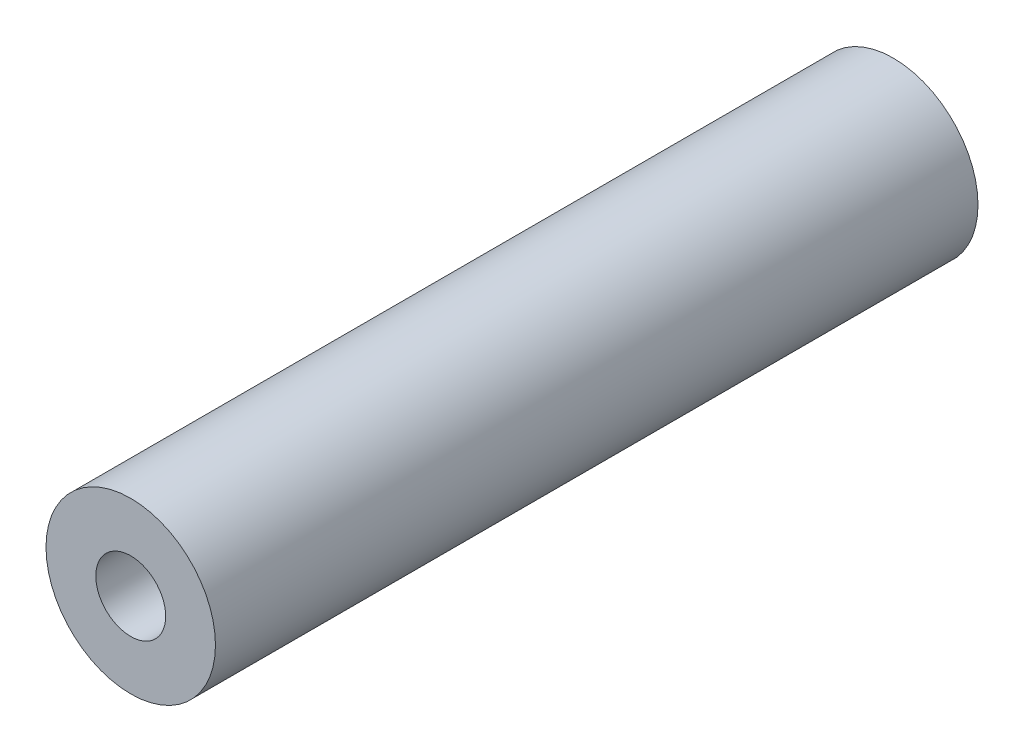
ISO-10303-21;
HEADER;
FILE_DESCRIPTION(('STEP AP214'),'2;1');
FILE_NAME('part.step','',(''),(''),'','','');
FILE_SCHEMA(('AUTOMOTIVE_DESIGN { 1 0 10303 214 1 1 1 1 }'));
ENDSEC;
DATA;
#1=APPLICATION_CONTEXT('core data for automotive mechanical design processes');
#2=APPLICATION_PROTOCOL_DEFINITION('international standard','automotive_design',2000,#1);
#3=PRODUCT_CONTEXT('',#1,'mechanical');
#4=PRODUCT('Part','Part','',(#3));
#5=PRODUCT_RELATED_PRODUCT_CATEGORY('part','',(#4));
#6=PRODUCT_DEFINITION_FORMATION('','',#4);
#7=PRODUCT_DEFINITION_CONTEXT('part definition',#1,'design');
#8=PRODUCT_DEFINITION('design','',#6,#7);
#9=PRODUCT_DEFINITION_SHAPE('','',#8);
#10=(LENGTH_UNIT() NAMED_UNIT(*) SI_UNIT(.MILLI.,.METRE.));
#11=(NAMED_UNIT(*) PLANE_ANGLE_UNIT() SI_UNIT($,.RADIAN.));
#12=(NAMED_UNIT(*) SI_UNIT($,.STERADIAN.) SOLID_ANGLE_UNIT());
#13=UNCERTAINTY_MEASURE_WITH_UNIT(LENGTH_MEASURE(1.E-05),#10,'distance_accuracy_value','');
#14=(GEOMETRIC_REPRESENTATION_CONTEXT(3) GLOBAL_UNCERTAINTY_ASSIGNED_CONTEXT((#13)) GLOBAL_UNIT_ASSIGNED_CONTEXT((#10,
#11,#12)) REPRESENTATION_CONTEXT('',''));
#15=CARTESIAN_POINT('',(0.,0.,0.));
#16=DIRECTION('',(0.,0.,1.));
#17=DIRECTION('',(1.,0.,0.));
#18=AXIS2_PLACEMENT_3D('',#15,#16,#17);
#19=CARTESIAN_POINT('',(-58.,-45.,36.));
#20=DIRECTION('',(0.,0.,-1.));
#21=DIRECTION('',(-1.,0.,0.));
#22=AXIS2_PLACEMENT_3D('',#19,#20,#21);
#23=CYLINDRICAL_SURFACE('',#22,4.);
#24=CARTESIAN_POINT('',(-58.,-45.,36.));
#25=DIRECTION('',(0.,0.,1.));
#26=DIRECTION('',(1.,0.,0.));
#27=AXIS2_PLACEMENT_3D('',#24,#25,#26);
#28=CIRCLE('',#27,4.);
#29=CARTESIAN_POINT('',(-54.,-45.,36.));
#30=VERTEX_POINT('',#29);
#31=EDGE_CURVE('E11',#30,#30,#28,.T.);
#32=ORIENTED_EDGE('',*,*,#31,.F.);
#33=EDGE_LOOP('',(#32));
#34=FACE_BOUND('',#33,.T.);
#35=CARTESIAN_POINT('',(-58.,-45.,0.));
#36=DIRECTION('',(0.,0.,1.));
#37=DIRECTION('',(1.,0.,0.));
#38=AXIS2_PLACEMENT_3D('',#35,#36,#37);
#39=CIRCLE('',#38,4.);
#40=CARTESIAN_POINT('',(-54.,-45.,0.));
#41=VERTEX_POINT('',#40);
#42=EDGE_CURVE('E19',#41,#41,#39,.T.);
#43=ORIENTED_EDGE('',*,*,#42,.T.);
#44=EDGE_LOOP('',(#43));
#45=FACE_BOUND('',#44,.T.);
#46=ADVANCED_FACE('F16',(#34,#45),#23,.T.);
#47=CARTESIAN_POINT('',(-58.,-45.,36.));
#48=DIRECTION('',(0.,0.,1.));
#49=DIRECTION('',(1.,0.,0.));
#50=AXIS2_PLACEMENT_3D('',#47,#48,#49);
#51=PLANE('',#50);
#52=CARTESIAN_POINT('',(-58.,-45.,36.));
#53=DIRECTION('',(0.,0.,1.));
#54=DIRECTION('',(1.,0.,0.));
#55=AXIS2_PLACEMENT_3D('',#52,#53,#54);
#56=CIRCLE('',#55,1.65);
#57=CARTESIAN_POINT('',(-56.35,-45.,36.));
#58=VERTEX_POINT('',#57);
#59=EDGE_CURVE('E40',#58,#58,#56,.T.);
#60=ORIENTED_EDGE('',*,*,#59,.F.);
#61=EDGE_LOOP('',(#60));
#62=FACE_BOUND('',#61,.T.);
#63=ORIENTED_EDGE('',*,*,#31,.T.);
#64=EDGE_LOOP('',(#63));
#65=FACE_BOUND('',#64,.T.);
#66=ADVANCED_FACE('F58',(#62,#65),#51,.T.);
#67=CARTESIAN_POINT('',(-58.,-45.,0.));
#68=DIRECTION('',(0.,0.,1.));
#69=DIRECTION('',(1.,0.,0.));
#70=AXIS2_PLACEMENT_3D('',#67,#68,#69);
#71=PLANE('',#70);
#72=CARTESIAN_POINT('',(-58.,-45.,0.));
#73=DIRECTION('',(0.,0.,-1.));
#74=DIRECTION('',(-1.,0.,0.));
#75=AXIS2_PLACEMENT_3D('',#72,#73,#74);
#76=CIRCLE('',#75,1.65);
#77=CARTESIAN_POINT('',(-59.65,-45.,0.));
#78=VERTEX_POINT('',#77);
#79=EDGE_CURVE('E39',#78,#78,#76,.T.);
#80=ORIENTED_EDGE('',*,*,#79,.F.);
#81=EDGE_LOOP('',(#80));
#82=FACE_BOUND('',#81,.T.);
#83=ORIENTED_EDGE('',*,*,#42,.F.);
#84=EDGE_LOOP('',(#83));
#85=FACE_BOUND('',#84,.T.);
#86=ADVANCED_FACE('F55',(#82,#85),#71,.F.);
#87=CARTESIAN_POINT('',(-58.,-45.,15.5));
#88=DIRECTION('',(0.,0.,-1.));
#89=DIRECTION('',(-1.,0.,0.));
#90=AXIS2_PLACEMENT_3D('',#87,#88,#89);
#91=CONICAL_SURFACE('',#90,1.65,1.02974425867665);
#92=CARTESIAN_POINT('',(-58.,-45.,16.4914200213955));
#93=VERTEX_POINT('',#92);
#94=VERTEX_LOOP('',#93);
#95=FACE_BOUND('',#94,.T.);
#96=CARTESIAN_POINT('',(-58.,-45.,15.5));
#97=DIRECTION('',(0.,0.,-1.));
#98=DIRECTION('',(-1.,0.,0.));
#99=AXIS2_PLACEMENT_3D('',#96,#97,#98);
#100=CIRCLE('',#99,1.65);
#101=CARTESIAN_POINT('',(-59.65,-45.,15.5));
#102=VERTEX_POINT('',#101);
#103=EDGE_CURVE('E43',#102,#102,#100,.T.);
#104=ORIENTED_EDGE('',*,*,#103,.T.);
#105=EDGE_LOOP('',(#104));
#106=FACE_BOUND('',#105,.T.);
#107=ADVANCED_FACE('F57',(#95,#106),#91,.F.);
#108=CARTESIAN_POINT('',(-58.,-45.,0.));
#109=DIRECTION('',(0.,0.,-1.));
#110=DIRECTION('',(-1.,0.,0.));
#111=AXIS2_PLACEMENT_3D('',#108,#109,#110);
#112=CYLINDRICAL_SURFACE('',#111,1.65);
#113=ORIENTED_EDGE('',*,*,#103,.F.);
#114=EDGE_LOOP('',(#113));
#115=FACE_BOUND('',#114,.T.);
#116=ORIENTED_EDGE('',*,*,#79,.T.);
#117=EDGE_LOOP('',(#116));
#118=FACE_BOUND('',#117,.T.);
#119=ADVANCED_FACE('F33',(#115,#118),#112,.F.);
#120=CARTESIAN_POINT('',(-58.,-45.,20.5));
#121=DIRECTION('',(0.,0.,1.));
#122=DIRECTION('',(1.,0.,0.));
#123=AXIS2_PLACEMENT_3D('',#120,#121,#122);
#124=CONICAL_SURFACE('',#123,1.65,1.02974425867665);
#125=CARTESIAN_POINT('',(-58.,-45.,19.5085799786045));
#126=VERTEX_POINT('',#125);
#127=VERTEX_LOOP('',#126);
#128=FACE_BOUND('',#127,.T.);
#129=CARTESIAN_POINT('',(-58.,-45.,20.5));
#130=DIRECTION('',(0.,0.,1.));
#131=DIRECTION('',(1.,0.,0.));
#132=AXIS2_PLACEMENT_3D('',#129,#130,#131);
#133=CIRCLE('',#132,1.65);
#134=CARTESIAN_POINT('',(-56.35,-45.,20.5));
#135=VERTEX_POINT('',#134);
#136=EDGE_CURVE('E37',#135,#135,#133,.T.);
#137=ORIENTED_EDGE('',*,*,#136,.T.);
#138=EDGE_LOOP('',(#137));
#139=FACE_BOUND('',#138,.T.);
#140=ADVANCED_FACE('F29',(#128,#139),#124,.F.);
#141=CARTESIAN_POINT('',(-58.,-45.,36.));
#142=DIRECTION('',(0.,0.,1.));
#143=DIRECTION('',(1.,0.,0.));
#144=AXIS2_PLACEMENT_3D('',#141,#142,#143);
#145=CYLINDRICAL_SURFACE('',#144,1.65);
#146=ORIENTED_EDGE('',*,*,#136,.F.);
#147=EDGE_LOOP('',(#146));
#148=FACE_BOUND('',#147,.T.);
#149=ORIENTED_EDGE('',*,*,#59,.T.);
#150=EDGE_LOOP('',(#149));
#151=FACE_BOUND('',#150,.T.);
#152=ADVANCED_FACE('F32',(#148,#151),#145,.F.);
#153=CLOSED_SHELL('',(#46,#66,#86,#107,#119,#140,#152));
#154=MANIFOLD_SOLID_BREP('B1',#153);
#155=ADVANCED_BREP_SHAPE_REPRESENTATION('',(#18,#154),#14);
#156=SHAPE_DEFINITION_REPRESENTATION(#9,#155);
ENDSEC;
END-ISO-10303-21;
